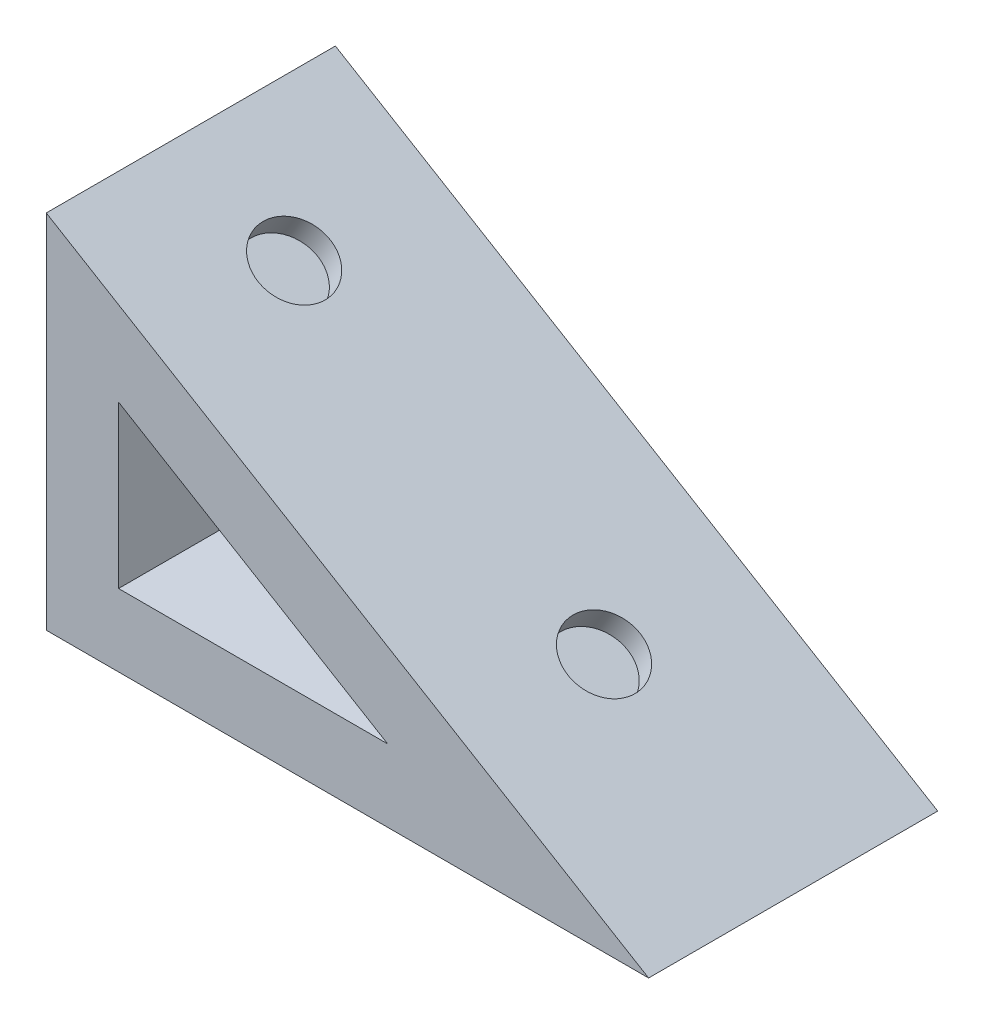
ISO-10303-21;
HEADER;
FILE_DESCRIPTION(('STEP AP214'),'2;1');
FILE_NAME('part.step','',(''),(''),'','','');
FILE_SCHEMA(('AUTOMOTIVE_DESIGN { 1 0 10303 214 1 1 1 1 }'));
ENDSEC;
DATA;
#1=APPLICATION_CONTEXT('core data for automotive mechanical design processes');
#2=APPLICATION_PROTOCOL_DEFINITION('international standard','automotive_design',2000,#1);
#3=PRODUCT_CONTEXT('',#1,'mechanical');
#4=PRODUCT('Part','Part','',(#3));
#5=PRODUCT_RELATED_PRODUCT_CATEGORY('part','',(#4));
#6=PRODUCT_DEFINITION_FORMATION('','',#4);
#7=PRODUCT_DEFINITION_CONTEXT('part definition',#1,'design');
#8=PRODUCT_DEFINITION('design','',#6,#7);
#9=PRODUCT_DEFINITION_SHAPE('','',#8);
#10=(LENGTH_UNIT() NAMED_UNIT(*) SI_UNIT(.MILLI.,.METRE.));
#11=(NAMED_UNIT(*) PLANE_ANGLE_UNIT() SI_UNIT($,.RADIAN.));
#12=(NAMED_UNIT(*) SI_UNIT($,.STERADIAN.) SOLID_ANGLE_UNIT());
#13=UNCERTAINTY_MEASURE_WITH_UNIT(LENGTH_MEASURE(1.E-05),#10,'distance_accuracy_value','');
#14=(GEOMETRIC_REPRESENTATION_CONTEXT(3) GLOBAL_UNCERTAINTY_ASSIGNED_CONTEXT((#13)) GLOBAL_UNIT_ASSIGNED_CONTEXT((#10,
#11,#12)) REPRESENTATION_CONTEXT('',''));
#15=CARTESIAN_POINT('',(0.,0.,0.));
#16=DIRECTION('',(0.,0.,1.));
#17=DIRECTION('',(1.,0.,0.));
#18=AXIS2_PLACEMENT_3D('',#15,#16,#17);
#19=CARTESIAN_POINT('',(0.,15.,12.));
#20=DIRECTION('',(1.,0.,0.));
#21=DIRECTION('',(0.,1.,0.));
#22=AXIS2_PLACEMENT_3D('',#19,#20,#21);
#23=PLANE('',#22);
#24=DIRECTION('',(0.,-1.,0.));
#25=VECTOR('',#24,1.);
#26=CARTESIAN_POINT('',(0.,15.,0.));
#27=LINE('',#26,#25);
#28=CARTESIAN_POINT('',(0.,15.,0.));
#29=VERTEX_POINT('',#28);
#30=CARTESIAN_POINT('',(0.,0.,0.));
#31=VERTEX_POINT('',#30);
#32=EDGE_CURVE('E147',#29,#31,#27,.T.);
#33=ORIENTED_EDGE('',*,*,#32,.T.);
#34=DIRECTION('',(0.,0.,-1.));
#35=VECTOR('',#34,1.);
#36=CARTESIAN_POINT('',(0.,0.,12.));
#37=LINE('',#36,#35);
#38=CARTESIAN_POINT('',(0.,0.,12.));
#39=VERTEX_POINT('',#38);
#40=EDGE_CURVE('E11',#39,#31,#37,.T.);
#41=ORIENTED_EDGE('',*,*,#40,.F.);
#42=DIRECTION('',(0.,-1.,0.));
#43=VECTOR('',#42,1.);
#44=CARTESIAN_POINT('',(0.,15.,12.));
#45=LINE('',#44,#43);
#46=CARTESIAN_POINT('',(0.,15.,12.));
#47=VERTEX_POINT('',#46);
#48=EDGE_CURVE('E150',#47,#39,#45,.T.);
#49=ORIENTED_EDGE('',*,*,#48,.F.);
#50=DIRECTION('',(0.,0.,-1.));
#51=VECTOR('',#50,1.);
#52=CARTESIAN_POINT('',(0.,15.,12.));
#53=LINE('',#52,#51);
#54=EDGE_CURVE('E154',#47,#29,#53,.T.);
#55=ORIENTED_EDGE('',*,*,#54,.T.);
#56=EDGE_LOOP('',(#33,#41,#49,#55));
#57=FACE_BOUND('',#56,.T.);
#58=ADVANCED_FACE('F35',(#57),#23,.F.);
#59=CARTESIAN_POINT('',(0.,0.,12.));
#60=DIRECTION('',(0.,1.,0.));
#61=DIRECTION('',(0.,0.,1.));
#62=AXIS2_PLACEMENT_3D('',#59,#60,#61);
#63=PLANE('',#62);
#64=CARTESIAN_POINT('',(18.,0.,6.));
#65=DIRECTION('',(0.,-1.,0.));
#66=DIRECTION('',(0.,0.,-1.));
#67=AXIS2_PLACEMENT_3D('',#64,#65,#66);
#68=CIRCLE('',#67,1.);
#69=CARTESIAN_POINT('',(18.,0.,5.));
#70=VERTEX_POINT('',#69);
#71=EDGE_CURVE('E135',#70,#70,#68,.T.);
#72=ORIENTED_EDGE('',*,*,#71,.F.);
#73=EDGE_LOOP('',(#72));
#74=FACE_BOUND('',#73,.T.);
#75=CARTESIAN_POINT('',(3.,0.,6.));
#76=DIRECTION('',(0.,-1.,0.));
#77=DIRECTION('',(0.,0.,-1.));
#78=AXIS2_PLACEMENT_3D('',#75,#76,#77);
#79=CIRCLE('',#78,2.);
#80=CARTESIAN_POINT('',(3.,0.,4.));
#81=VERTEX_POINT('',#80);
#82=EDGE_CURVE('E141',#81,#81,#79,.T.);
#83=ORIENTED_EDGE('',*,*,#82,.F.);
#84=EDGE_LOOP('',(#83));
#85=FACE_BOUND('',#84,.T.);
#86=DIRECTION('',(1.,0.,0.));
#87=VECTOR('',#86,1.);
#88=CARTESIAN_POINT('',(0.,0.,0.));
#89=LINE('',#88,#87);
#90=CARTESIAN_POINT('',(25.,0.,0.));
#91=VERTEX_POINT('',#90);
#92=EDGE_CURVE('E157',#31,#91,#89,.T.);
#93=ORIENTED_EDGE('',*,*,#92,.T.);
#94=DIRECTION('',(0.,0.,-1.));
#95=VECTOR('',#94,1.);
#96=CARTESIAN_POINT('',(25.,0.,12.));
#97=LINE('',#96,#95);
#98=CARTESIAN_POINT('',(25.,0.,12.));
#99=VERTEX_POINT('',#98);
#100=EDGE_CURVE('E42',#99,#91,#97,.T.);
#101=ORIENTED_EDGE('',*,*,#100,.F.);
#102=DIRECTION('',(1.,0.,0.));
#103=VECTOR('',#102,1.);
#104=CARTESIAN_POINT('',(0.,0.,12.));
#105=LINE('',#104,#103);
#106=EDGE_CURVE('E80',#39,#99,#105,.T.);
#107=ORIENTED_EDGE('',*,*,#106,.F.);
#108=ORIENTED_EDGE('',*,*,#40,.T.);
#109=EDGE_LOOP('',(#93,#101,#107,#108));
#110=FACE_BOUND('',#109,.T.);
#111=ADVANCED_FACE('F178',(#74,#85,#110),#63,.F.);
#112=CARTESIAN_POINT('',(25.,0.,12.));
#113=DIRECTION('',(-0.514495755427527,-0.857492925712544,0.));
#114=DIRECTION('',(0.857492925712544,-0.514495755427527,0.));
#115=AXIS2_PLACEMENT_3D('',#112,#113,#114);
#116=PLANE('',#115);
#117=CARTESIAN_POINT('',(4.28746462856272,12.4275212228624,6.));
#118=DIRECTION('',(0.514495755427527,0.857492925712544,0.));
#119=DIRECTION('',(-0.857492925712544,0.514495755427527,0.));
#120=AXIS2_PLACEMENT_3D('',#117,#118,#119);
#121=CIRCLE('',#120,1.5);
#122=CARTESIAN_POINT('',(3.00122523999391,13.1992648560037,6.));
#123=VERTEX_POINT('',#122);
#124=EDGE_CURVE('E126',#123,#123,#121,.T.);
#125=ORIENTED_EDGE('',*,*,#124,.F.);
#126=EDGE_LOOP('',(#125));
#127=FACE_BOUND('',#126,.T.);
#128=CARTESIAN_POINT('',(17.1498585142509,4.71008489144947,6.));
#129=DIRECTION('',(0.514495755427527,0.857492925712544,0.));
#130=DIRECTION('',(-0.857492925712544,0.514495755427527,0.));
#131=AXIS2_PLACEMENT_3D('',#128,#129,#130);
#132=CIRCLE('',#131,1.5);
#133=CARTESIAN_POINT('',(15.8636191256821,5.48182852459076,6.));
#134=VERTEX_POINT('',#133);
#135=EDGE_CURVE('E129',#134,#134,#132,.T.);
#136=ORIENTED_EDGE('',*,*,#135,.F.);
#137=EDGE_LOOP('',(#136));
#138=FACE_BOUND('',#137,.T.);
#139=DIRECTION('',(-0.857492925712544,0.514495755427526,0.));
#140=VECTOR('',#139,1.);
#141=CARTESIAN_POINT('',(25.,0.,0.));
#142=LINE('',#141,#140);
#143=EDGE_CURVE('E75',#91,#29,#142,.T.);
#144=ORIENTED_EDGE('',*,*,#143,.T.);
#145=ORIENTED_EDGE('',*,*,#54,.F.);
#146=DIRECTION('',(-0.857492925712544,0.514495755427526,0.));
#147=VECTOR('',#146,1.);
#148=CARTESIAN_POINT('',(25.,0.,12.));
#149=LINE('',#148,#147);
#150=EDGE_CURVE('E58',#99,#47,#149,.T.);
#151=ORIENTED_EDGE('',*,*,#150,.F.);
#152=ORIENTED_EDGE('',*,*,#100,.T.);
#153=EDGE_LOOP('',(#144,#145,#151,#152));
#154=FACE_BOUND('',#153,.T.);
#155=ADVANCED_FACE('F160',(#127,#138,#154),#116,.F.);
#156=CARTESIAN_POINT('',(0.,0.,12.));
#157=DIRECTION('',(0.,0.,1.));
#158=DIRECTION('',(1.,0.,0.));
#159=AXIS2_PLACEMENT_3D('',#156,#157,#158);
#160=PLANE('',#159);
#161=DIRECTION('',(-0.857492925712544,0.514495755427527,0.));
#162=VECTOR('',#161,1.);
#163=CARTESIAN_POINT('',(14.1690481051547,3.,12.));
#164=LINE('',#163,#162);
#165=CARTESIAN_POINT('',(14.1690481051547,3.,12.));
#166=VERTEX_POINT('',#165);
#167=CARTESIAN_POINT('',(3.,9.70142886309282,12.));
#168=VERTEX_POINT('',#167);
#169=EDGE_CURVE('E49',#166,#168,#164,.T.);
#170=ORIENTED_EDGE('',*,*,#169,.F.);
#171=DIRECTION('',(1.,0.,0.));
#172=VECTOR('',#171,1.);
#173=CARTESIAN_POINT('',(3.,3.,12.));
#174=LINE('',#173,#172);
#175=CARTESIAN_POINT('',(3.,3.,12.));
#176=VERTEX_POINT('',#175);
#177=EDGE_CURVE('E113',#176,#166,#174,.T.);
#178=ORIENTED_EDGE('',*,*,#177,.F.);
#179=DIRECTION('',(0.,-1.,0.));
#180=VECTOR('',#179,1.);
#181=CARTESIAN_POINT('',(3.,9.70142886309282,12.));
#182=LINE('',#181,#180);
#183=EDGE_CURVE('E116',#168,#176,#182,.T.);
#184=ORIENTED_EDGE('',*,*,#183,.F.);
#185=EDGE_LOOP('',(#170,#178,#184));
#186=FACE_BOUND('',#185,.T.);
#187=ORIENTED_EDGE('',*,*,#48,.T.);
#188=ORIENTED_EDGE('',*,*,#106,.T.);
#189=ORIENTED_EDGE('',*,*,#150,.T.);
#190=EDGE_LOOP('',(#187,#188,#189));
#191=FACE_BOUND('',#190,.T.);
#192=ADVANCED_FACE('F167',(#186,#191),#160,.T.);
#193=CARTESIAN_POINT('',(0.,0.,0.));
#194=DIRECTION('',(0.,0.,1.));
#195=DIRECTION('',(1.,0.,0.));
#196=AXIS2_PLACEMENT_3D('',#193,#194,#195);
#197=PLANE('',#196);
#198=ORIENTED_EDGE('',*,*,#32,.F.);
#199=ORIENTED_EDGE('',*,*,#143,.F.);
#200=ORIENTED_EDGE('',*,*,#92,.F.);
#201=EDGE_LOOP('',(#198,#199,#200));
#202=FACE_BOUND('',#201,.T.);
#203=ADVANCED_FACE('F163',(#202),#197,.F.);
#204=CARTESIAN_POINT('',(3.,2.,6.));
#205=DIRECTION('',(0.,-1.,0.));
#206=DIRECTION('',(0.,0.,-1.));
#207=AXIS2_PLACEMENT_3D('',#204,#205,#206);
#208=CYLINDRICAL_SURFACE('',#207,2.);
#209=CARTESIAN_POINT('',(3.,2.,6.));
#210=DIRECTION('',(0.,-1.,0.));
#211=DIRECTION('',(0.,0.,-1.));
#212=AXIS2_PLACEMENT_3D('',#209,#210,#211);
#213=CIRCLE('',#212,2.);
#214=CARTESIAN_POINT('',(3.,2.,4.));
#215=VERTEX_POINT('',#214);
#216=EDGE_CURVE('E144',#215,#215,#213,.T.);
#217=ORIENTED_EDGE('',*,*,#216,.F.);
#218=EDGE_LOOP('',(#217));
#219=FACE_BOUND('',#218,.T.);
#220=ORIENTED_EDGE('',*,*,#82,.T.);
#221=EDGE_LOOP('',(#220));
#222=FACE_BOUND('',#221,.T.);
#223=ADVANCED_FACE('F175',(#219,#222),#208,.F.);
#224=CARTESIAN_POINT('',(3.,2.,6.));
#225=DIRECTION('',(0.,-1.,0.));
#226=DIRECTION('',(0.,0.,-1.));
#227=AXIS2_PLACEMENT_3D('',#224,#225,#226);
#228=PLANE('',#227);
#229=ORIENTED_EDGE('',*,*,#216,.T.);
#230=EDGE_LOOP('',(#229));
#231=FACE_BOUND('',#230,.T.);
#232=ADVANCED_FACE('F195',(#231),#228,.T.);
#233=CARTESIAN_POINT('',(18.,2.,6.));
#234=DIRECTION('',(0.,-1.,0.));
#235=DIRECTION('',(0.,0.,-1.));
#236=AXIS2_PLACEMENT_3D('',#233,#234,#235);
#237=CYLINDRICAL_SURFACE('',#236,1.);
#238=CARTESIAN_POINT('',(18.,2.,6.));
#239=DIRECTION('',(0.,-1.,0.));
#240=DIRECTION('',(0.,0.,-1.));
#241=AXIS2_PLACEMENT_3D('',#238,#239,#240);
#242=CIRCLE('',#241,1.);
#243=CARTESIAN_POINT('',(18.,2.,5.));
#244=VERTEX_POINT('',#243);
#245=EDGE_CURVE('E138',#244,#244,#242,.T.);
#246=ORIENTED_EDGE('',*,*,#245,.F.);
#247=EDGE_LOOP('',(#246));
#248=FACE_BOUND('',#247,.T.);
#249=ORIENTED_EDGE('',*,*,#71,.T.);
#250=EDGE_LOOP('',(#249));
#251=FACE_BOUND('',#250,.T.);
#252=ADVANCED_FACE('F200',(#248,#251),#237,.F.);
#253=CARTESIAN_POINT('',(18.,2.,6.));
#254=DIRECTION('',(0.,-1.,0.));
#255=DIRECTION('',(0.,0.,-1.));
#256=AXIS2_PLACEMENT_3D('',#253,#254,#255);
#257=PLANE('',#256);
#258=ORIENTED_EDGE('',*,*,#245,.T.);
#259=EDGE_LOOP('',(#258));
#260=FACE_BOUND('',#259,.T.);
#261=ADVANCED_FACE('F207',(#260),#257,.T.);
#262=CARTESIAN_POINT('',(16.6353627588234,3.85259196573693,6.));
#263=DIRECTION('',(0.514495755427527,0.857492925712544,0.));
#264=DIRECTION('',(-0.857492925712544,0.514495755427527,0.));
#265=AXIS2_PLACEMENT_3D('',#262,#263,#264);
#266=CYLINDRICAL_SURFACE('',#265,1.5);
#267=CARTESIAN_POINT('',(16.6353627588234,3.85259196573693,6.));
#268=DIRECTION('',(0.514495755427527,0.857492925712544,0.));
#269=DIRECTION('',(-0.857492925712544,0.514495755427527,0.));
#270=AXIS2_PLACEMENT_3D('',#267,#268,#269);
#271=CIRCLE('',#270,1.5);
#272=CARTESIAN_POINT('',(15.3491233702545,4.62433559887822,6.));
#273=VERTEX_POINT('',#272);
#274=EDGE_CURVE('E132',#273,#273,#271,.T.);
#275=ORIENTED_EDGE('',*,*,#274,.F.);
#276=EDGE_LOOP('',(#275));
#277=FACE_BOUND('',#276,.T.);
#278=ORIENTED_EDGE('',*,*,#135,.T.);
#279=EDGE_LOOP('',(#278));
#280=FACE_BOUND('',#279,.T.);
#281=ADVANCED_FACE('F211',(#277,#280),#266,.F.);
#282=CARTESIAN_POINT('',(6.10315130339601,10.1719188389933,0.));
#283=DIRECTION('',(0.514495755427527,0.857492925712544,0.));
#284=DIRECTION('',(-0.857492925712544,0.514495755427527,0.));
#285=AXIS2_PLACEMENT_3D('',#282,#283,#284);
#286=PLANE('',#285);
#287=ORIENTED_EDGE('',*,*,#274,.T.);
#288=EDGE_LOOP('',(#287));
#289=FACE_BOUND('',#288,.T.);
#290=ADVANCED_FACE('F215',(#289),#286,.T.);
#291=CARTESIAN_POINT('',(3.7729688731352,11.5700282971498,6.));
#292=DIRECTION('',(0.514495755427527,0.857492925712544,0.));
#293=DIRECTION('',(-0.857492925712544,0.514495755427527,0.));
#294=AXIS2_PLACEMENT_3D('',#291,#292,#293);
#295=CYLINDRICAL_SURFACE('',#294,1.5);
#296=CARTESIAN_POINT('',(3.7729688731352,11.5700282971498,6.));
#297=DIRECTION('',(0.514495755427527,0.857492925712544,0.));
#298=DIRECTION('',(-0.857492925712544,0.514495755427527,0.));
#299=AXIS2_PLACEMENT_3D('',#296,#297,#298);
#300=CIRCLE('',#299,1.5);
#301=CARTESIAN_POINT('',(2.48672948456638,12.3417719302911,6.));
#302=VERTEX_POINT('',#301);
#303=EDGE_CURVE('E124',#302,#302,#300,.T.);
#304=ORIENTED_EDGE('',*,*,#303,.F.);
#305=EDGE_LOOP('',(#304));
#306=FACE_BOUND('',#305,.T.);
#307=ORIENTED_EDGE('',*,*,#124,.T.);
#308=EDGE_LOOP('',(#307));
#309=FACE_BOUND('',#308,.T.);
#310=ADVANCED_FACE('F219',(#306,#309),#295,.F.);
#311=CARTESIAN_POINT('',(3.7729688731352,11.5700282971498,6.));
#312=DIRECTION('',(0.514495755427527,0.857492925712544,0.));
#313=DIRECTION('',(-0.857492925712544,0.514495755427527,0.));
#314=AXIS2_PLACEMENT_3D('',#311,#312,#313);
#315=PLANE('',#314);
#316=ORIENTED_EDGE('',*,*,#303,.T.);
#317=EDGE_LOOP('',(#316));
#318=FACE_BOUND('',#317,.T.);
#319=ADVANCED_FACE('F221',(#318),#315,.T.);
#320=CARTESIAN_POINT('',(14.1690481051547,3.,2.));
#321=DIRECTION('',(0.514495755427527,0.857492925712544,0.));
#322=DIRECTION('',(-0.857492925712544,0.514495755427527,0.));
#323=AXIS2_PLACEMENT_3D('',#320,#321,#322);
#324=PLANE('',#323);
#325=ORIENTED_EDGE('',*,*,#169,.T.);
#326=DIRECTION('',(0.,0.,1.));
#327=VECTOR('',#326,1.);
#328=CARTESIAN_POINT('',(3.,9.70142886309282,2.));
#329=LINE('',#328,#327);
#330=CARTESIAN_POINT('',(3.,9.70142886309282,2.));
#331=VERTEX_POINT('',#330);
#332=EDGE_CURVE('E94',#331,#168,#329,.T.);
#333=ORIENTED_EDGE('',*,*,#332,.F.);
#334=DIRECTION('',(-0.857492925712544,0.514495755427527,0.));
#335=VECTOR('',#334,1.);
#336=CARTESIAN_POINT('',(14.1690481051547,3.,2.));
#337=LINE('',#336,#335);
#338=CARTESIAN_POINT('',(14.1690481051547,3.,2.));
#339=VERTEX_POINT('',#338);
#340=EDGE_CURVE('E98',#339,#331,#337,.T.);
#341=ORIENTED_EDGE('',*,*,#340,.F.);
#342=DIRECTION('',(0.,0.,1.));
#343=VECTOR('',#342,1.);
#344=CARTESIAN_POINT('',(14.1690481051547,3.,2.));
#345=LINE('',#344,#343);
#346=EDGE_CURVE('E122',#339,#166,#345,.T.);
#347=ORIENTED_EDGE('',*,*,#346,.T.);
#348=EDGE_LOOP('',(#325,#333,#341,#347));
#349=FACE_BOUND('',#348,.T.);
#350=ADVANCED_FACE('F96',(#349),#324,.F.);
#351=CARTESIAN_POINT('',(3.,3.,2.));
#352=DIRECTION('',(0.,-1.,0.));
#353=DIRECTION('',(0.,0.,-1.));
#354=AXIS2_PLACEMENT_3D('',#351,#352,#353);
#355=PLANE('',#354);
#356=ORIENTED_EDGE('',*,*,#177,.T.);
#357=ORIENTED_EDGE('',*,*,#346,.F.);
#358=DIRECTION('',(1.,0.,0.));
#359=VECTOR('',#358,1.);
#360=CARTESIAN_POINT('',(3.,3.,2.));
#361=LINE('',#360,#359);
#362=CARTESIAN_POINT('',(3.,3.,2.));
#363=VERTEX_POINT('',#362);
#364=EDGE_CURVE('E104',#363,#339,#361,.T.);
#365=ORIENTED_EDGE('',*,*,#364,.F.);
#366=DIRECTION('',(0.,0.,1.));
#367=VECTOR('',#366,1.);
#368=CARTESIAN_POINT('',(3.,3.,2.));
#369=LINE('',#368,#367);
#370=EDGE_CURVE('E103',#363,#176,#369,.T.);
#371=ORIENTED_EDGE('',*,*,#370,.T.);
#372=EDGE_LOOP('',(#356,#357,#365,#371));
#373=FACE_BOUND('',#372,.T.);
#374=ADVANCED_FACE('F230',(#373),#355,.F.);
#375=CARTESIAN_POINT('',(3.,9.70142886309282,2.));
#376=DIRECTION('',(-1.,0.,0.));
#377=DIRECTION('',(0.,0.,1.));
#378=AXIS2_PLACEMENT_3D('',#375,#376,#377);
#379=PLANE('',#378);
#380=ORIENTED_EDGE('',*,*,#183,.T.);
#381=ORIENTED_EDGE('',*,*,#370,.F.);
#382=DIRECTION('',(0.,-1.,0.));
#383=VECTOR('',#382,1.);
#384=CARTESIAN_POINT('',(3.,9.70142886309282,2.));
#385=LINE('',#384,#383);
#386=EDGE_CURVE('E107',#331,#363,#385,.T.);
#387=ORIENTED_EDGE('',*,*,#386,.F.);
#388=ORIENTED_EDGE('',*,*,#332,.T.);
#389=EDGE_LOOP('',(#380,#381,#387,#388));
#390=FACE_BOUND('',#389,.T.);
#391=ADVANCED_FACE('F108',(#390),#379,.F.);
#392=CARTESIAN_POINT('',(0.,0.,2.));
#393=DIRECTION('',(0.,0.,1.));
#394=DIRECTION('',(1.,0.,0.));
#395=AXIS2_PLACEMENT_3D('',#392,#393,#394);
#396=PLANE('',#395);
#397=ORIENTED_EDGE('',*,*,#340,.T.);
#398=ORIENTED_EDGE('',*,*,#386,.T.);
#399=ORIENTED_EDGE('',*,*,#364,.T.);
#400=EDGE_LOOP('',(#397,#398,#399));
#401=FACE_BOUND('',#400,.T.);
#402=ADVANCED_FACE('F112',(#401),#396,.T.);
#403=CLOSED_SHELL('',(#58,#111,#155,#192,#203,#223,#232,#252,#261,#281,#290,#310,#319,#350,#374,
#391,#402));
#404=MANIFOLD_SOLID_BREP('B2',#403);
#405=ADVANCED_BREP_SHAPE_REPRESENTATION('',(#18,#404),#14);
#406=SHAPE_DEFINITION_REPRESENTATION(#9,#405);
ENDSEC;
END-ISO-10303-21;
